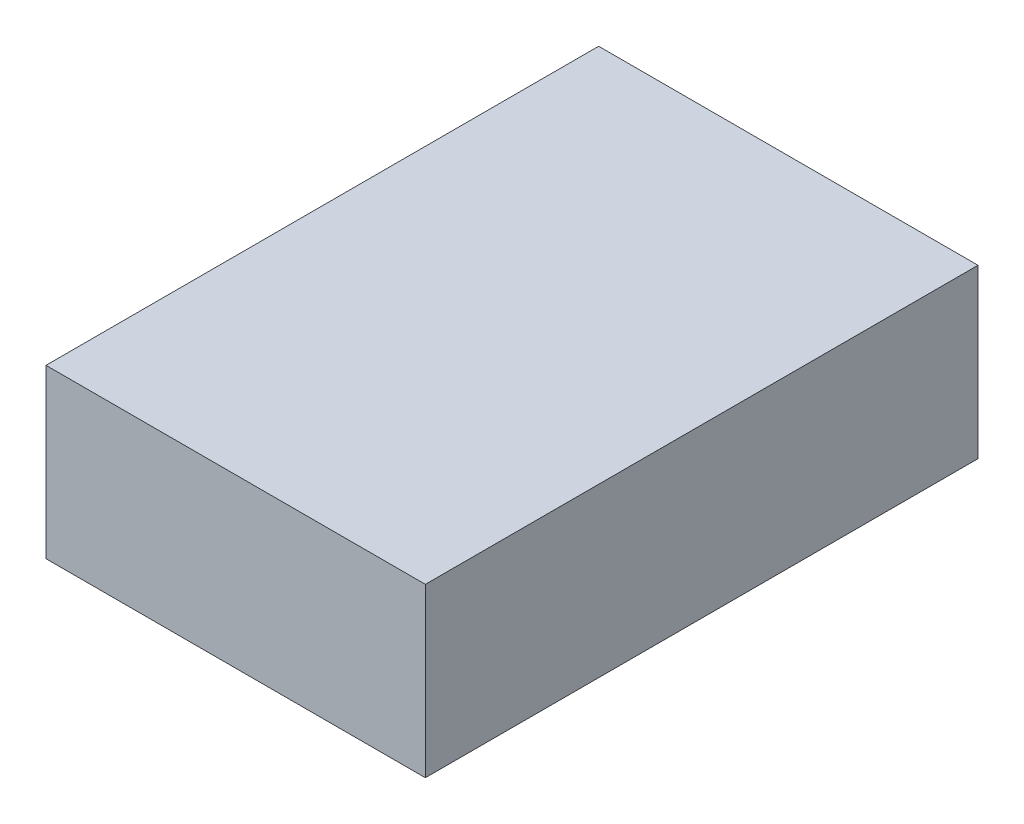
ISO-10303-21;
HEADER;
FILE_DESCRIPTION(('STEP AP214'),'2;1');
FILE_NAME('part.step','',(''),(''),'','','');
FILE_SCHEMA(('AUTOMOTIVE_DESIGN { 1 0 10303 214 1 1 1 1 }'));
ENDSEC;
DATA;
#1=APPLICATION_CONTEXT('core data for automotive mechanical design processes');
#2=APPLICATION_PROTOCOL_DEFINITION('international standard','automotive_design',2000,#1);
#3=PRODUCT_CONTEXT('',#1,'mechanical');
#4=PRODUCT('Part','Part','',(#3));
#5=PRODUCT_RELATED_PRODUCT_CATEGORY('part','',(#4));
#6=PRODUCT_DEFINITION_FORMATION('','',#4);
#7=PRODUCT_DEFINITION_CONTEXT('part definition',#1,'design');
#8=PRODUCT_DEFINITION('design','',#6,#7);
#9=PRODUCT_DEFINITION_SHAPE('','',#8);
#10=(LENGTH_UNIT() NAMED_UNIT(*) SI_UNIT(.MILLI.,.METRE.));
#11=(NAMED_UNIT(*) PLANE_ANGLE_UNIT() SI_UNIT($,.RADIAN.));
#12=(NAMED_UNIT(*) SI_UNIT($,.STERADIAN.) SOLID_ANGLE_UNIT());
#13=UNCERTAINTY_MEASURE_WITH_UNIT(LENGTH_MEASURE(1.E-05),#10,'distance_accuracy_value','');
#14=(GEOMETRIC_REPRESENTATION_CONTEXT(3) GLOBAL_UNCERTAINTY_ASSIGNED_CONTEXT((#13)) GLOBAL_UNIT_ASSIGNED_CONTEXT((#10,
#11,#12)) REPRESENTATION_CONTEXT('',''));
#15=CARTESIAN_POINT('',(0.,0.,0.));
#16=DIRECTION('',(0.,0.,1.));
#17=DIRECTION('',(1.,0.,0.));
#18=AXIS2_PLACEMENT_3D('',#15,#16,#17);
#19=CARTESIAN_POINT('',(-102.966766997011,45.467033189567,-16.81));
#20=DIRECTION('',(0.,-1.,0.));
#21=DIRECTION('',(1.,0.,0.));
#22=AXIS2_PLACEMENT_3D('',#19,#20,#21);
#23=PLANE('',#22);
#24=DIRECTION('',(0.,0.,-1.));
#25=VECTOR('',#24,1.);
#26=CARTESIAN_POINT('',(-102.966766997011,45.467033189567,283.2));
#27=LINE('',#26,#25);
#28=CARTESIAN_POINT('',(-102.966766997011,45.467033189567,283.2));
#29=VERTEX_POINT('',#28);
#30=CARTESIAN_POINT('',(-102.966766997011,45.467033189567,-16.8));
#31=VERTEX_POINT('',#30);
#32=EDGE_CURVE('E84',#29,#31,#27,.T.);
#33=ORIENTED_EDGE('',*,*,#32,.T.);
#34=DIRECTION('',(1.,0.,0.));
#35=VECTOR('',#34,1.);
#36=CARTESIAN_POINT('',(0.,45.467033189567,-16.8));
#37=LINE('',#36,#35);
#38=CARTESIAN_POINT('',(102.966766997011,45.467033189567,-16.8));
#39=VERTEX_POINT('',#38);
#40=EDGE_CURVE('E77',#31,#39,#37,.T.);
#41=ORIENTED_EDGE('',*,*,#40,.T.);
#42=DIRECTION('',(0.,0.,1.));
#43=VECTOR('',#42,1.);
#44=CARTESIAN_POINT('',(102.966766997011,45.467033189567,283.2));
#45=LINE('',#44,#43);
#46=CARTESIAN_POINT('',(102.966766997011,45.467033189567,283.2));
#47=VERTEX_POINT('',#46);
#48=EDGE_CURVE('E80',#39,#47,#45,.T.);
#49=ORIENTED_EDGE('',*,*,#48,.T.);
#50=DIRECTION('',(1.,0.,0.));
#51=VECTOR('',#50,1.);
#52=CARTESIAN_POINT('',(0.,45.467033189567,283.2));
#53=LINE('',#52,#51);
#54=EDGE_CURVE('E64',#29,#47,#53,.T.);
#55=ORIENTED_EDGE('',*,*,#54,.F.);
#56=EDGE_LOOP('',(#33,#41,#49,#55));
#57=FACE_BOUND('',#56,.T.);
#58=ADVANCED_FACE('F32',(#57),#23,.T.);
#59=CARTESIAN_POINT('',(102.966766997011,136.401099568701,283.2));
#60=DIRECTION('',(-1.,0.,0.));
#61=DIRECTION('',(0.,0.,1.));
#62=AXIS2_PLACEMENT_3D('',#59,#60,#61);
#63=PLANE('',#62);
#64=ORIENTED_EDGE('',*,*,#48,.F.);
#65=DIRECTION('',(0.,1.,0.));
#66=VECTOR('',#65,1.);
#67=CARTESIAN_POINT('',(102.966766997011,136.401099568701,-16.8));
#68=LINE('',#67,#66);
#69=CARTESIAN_POINT('',(102.966766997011,136.401099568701,-16.8));
#70=VERTEX_POINT('',#69);
#71=EDGE_CURVE('E11',#39,#70,#68,.T.);
#72=ORIENTED_EDGE('',*,*,#71,.T.);
#73=DIRECTION('',(0.,0.,-1.));
#74=VECTOR('',#73,1.);
#75=CARTESIAN_POINT('',(102.966766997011,136.401099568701,283.2));
#76=LINE('',#75,#74);
#77=CARTESIAN_POINT('',(102.966766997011,136.401099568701,283.2));
#78=VERTEX_POINT('',#77);
#79=EDGE_CURVE('E103',#78,#70,#76,.T.);
#80=ORIENTED_EDGE('',*,*,#79,.F.);
#81=DIRECTION('',(0.,1.,0.));
#82=VECTOR('',#81,1.);
#83=CARTESIAN_POINT('',(102.966766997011,136.401099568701,283.2));
#84=LINE('',#83,#82);
#85=EDGE_CURVE('E82',#47,#78,#84,.T.);
#86=ORIENTED_EDGE('',*,*,#85,.F.);
#87=EDGE_LOOP('',(#64,#72,#80,#86));
#88=FACE_BOUND('',#87,.T.);
#89=ADVANCED_FACE('F81',(#88),#63,.F.);
#90=CARTESIAN_POINT('',(-102.966766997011,136.401099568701,283.2));
#91=DIRECTION('',(1.,0.,0.));
#92=DIRECTION('',(0.,0.,-1.));
#93=AXIS2_PLACEMENT_3D('',#90,#91,#92);
#94=PLANE('',#93);
#95=ORIENTED_EDGE('',*,*,#32,.F.);
#96=DIRECTION('',(0.,-1.,0.));
#97=VECTOR('',#96,1.);
#98=CARTESIAN_POINT('',(-102.966766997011,136.401099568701,283.2));
#99=LINE('',#98,#97);
#100=CARTESIAN_POINT('',(-102.966766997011,136.401099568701,283.2));
#101=VERTEX_POINT('',#100);
#102=EDGE_CURVE('E91',#101,#29,#99,.T.);
#103=ORIENTED_EDGE('',*,*,#102,.F.);
#104=DIRECTION('',(0.,0.,-1.));
#105=VECTOR('',#104,1.);
#106=CARTESIAN_POINT('',(-102.966766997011,136.401099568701,283.2));
#107=LINE('',#106,#105);
#108=CARTESIAN_POINT('',(-102.966766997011,136.401099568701,-16.8));
#109=VERTEX_POINT('',#108);
#110=EDGE_CURVE('E93',#101,#109,#107,.T.);
#111=ORIENTED_EDGE('',*,*,#110,.T.);
#112=DIRECTION('',(0.,-1.,0.));
#113=VECTOR('',#112,1.);
#114=CARTESIAN_POINT('',(-102.966766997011,136.401099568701,-16.8));
#115=LINE('',#114,#113);
#116=EDGE_CURVE('E94',#109,#31,#115,.T.);
#117=ORIENTED_EDGE('',*,*,#116,.T.);
#118=EDGE_LOOP('',(#95,#103,#111,#117));
#119=FACE_BOUND('',#118,.T.);
#120=ADVANCED_FACE('F105',(#119),#94,.F.);
#121=CARTESIAN_POINT('',(0.,45.467033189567,283.2));
#122=DIRECTION('',(0.,0.,1.));
#123=DIRECTION('',(1.,0.,0.));
#124=AXIS2_PLACEMENT_3D('',#121,#122,#123);
#125=PLANE('',#124);
#126=ORIENTED_EDGE('',*,*,#102,.T.);
#127=ORIENTED_EDGE('',*,*,#54,.T.);
#128=ORIENTED_EDGE('',*,*,#85,.T.);
#129=DIRECTION('',(-1.,0.,0.));
#130=VECTOR('',#129,1.);
#131=CARTESIAN_POINT('',(-102.966766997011,136.401099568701,283.2));
#132=LINE('',#131,#130);
#133=EDGE_CURVE('E59',#78,#101,#132,.T.);
#134=ORIENTED_EDGE('',*,*,#133,.T.);
#135=EDGE_LOOP('',(#126,#127,#128,#134));
#136=FACE_BOUND('',#135,.T.);
#137=ADVANCED_FACE('F34',(#136),#125,.T.);
#138=CARTESIAN_POINT('',(0.,45.467033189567,-16.8));
#139=DIRECTION('',(0.,0.,1.));
#140=DIRECTION('',(1.,0.,0.));
#141=AXIS2_PLACEMENT_3D('',#138,#139,#140);
#142=PLANE('',#141);
#143=ORIENTED_EDGE('',*,*,#40,.F.);
#144=ORIENTED_EDGE('',*,*,#116,.F.);
#145=DIRECTION('',(-1.,0.,0.));
#146=VECTOR('',#145,1.);
#147=CARTESIAN_POINT('',(-102.966766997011,136.401099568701,-16.8));
#148=LINE('',#147,#146);
#149=EDGE_CURVE('E41',#70,#109,#148,.T.);
#150=ORIENTED_EDGE('',*,*,#149,.F.);
#151=ORIENTED_EDGE('',*,*,#71,.F.);
#152=EDGE_LOOP('',(#143,#144,#150,#151));
#153=FACE_BOUND('',#152,.T.);
#154=ADVANCED_FACE('F74',(#153),#142,.F.);
#155=CARTESIAN_POINT('',(-102.966766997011,136.401099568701,283.2));
#156=DIRECTION('',(0.,-1.,0.));
#157=DIRECTION('',(0.,0.,-1.));
#158=AXIS2_PLACEMENT_3D('',#155,#156,#157);
#159=PLANE('',#158);
#160=ORIENTED_EDGE('',*,*,#149,.T.);
#161=ORIENTED_EDGE('',*,*,#110,.F.);
#162=ORIENTED_EDGE('',*,*,#133,.F.);
#163=ORIENTED_EDGE('',*,*,#79,.T.);
#164=EDGE_LOOP('',(#160,#161,#162,#163));
#165=FACE_BOUND('',#164,.T.);
#166=ADVANCED_FACE('F106',(#165),#159,.F.);
#167=CLOSED_SHELL('',(#58,#89,#120,#137,#154,#166));
#168=MANIFOLD_SOLID_BREP('B2',#167);
#169=ADVANCED_BREP_SHAPE_REPRESENTATION('',(#18,#168),#14);
#170=SHAPE_DEFINITION_REPRESENTATION(#9,#169);
ENDSEC;
END-ISO-10303-21;
